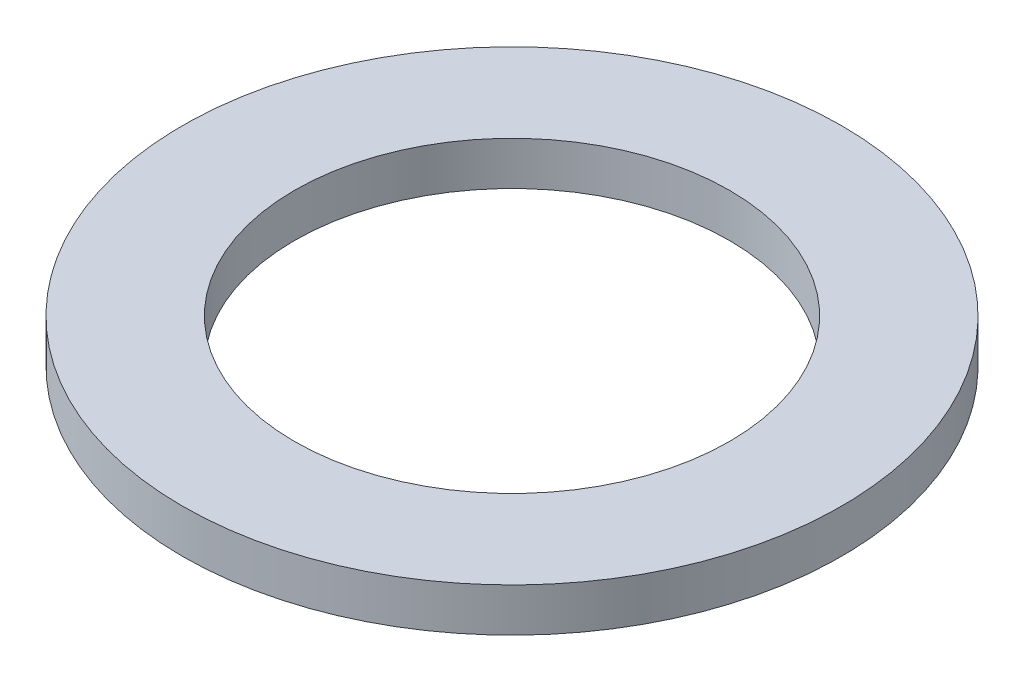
from build123d import *

# Parameters (mm, degrees)
SKETCH1_R           = 15.15
SKETCH1_R_2         = 10
BOSS_EXTRUDE1_DEPTH = 2


with BuildPart() as part:
    # Sketch1 → Boss-Extrude1 (new body)
    with BuildSketch(Plane(origin=(0, 0, 0), x_dir=(1, 0, 0), z_dir=(0, 1, 0))):
        with Locations(Location((0, 0, 0), (0, 0, 270))):
            Circle(SKETCH1_R)
        with Locations(Location((0, 0, 0), (0, 0, 270))):
            Circle(SKETCH1_R_2, mode=Mode.SUBTRACT)
    extrude(amount=BOSS_EXTRUDE1_DEPTH)


solid = part.part
